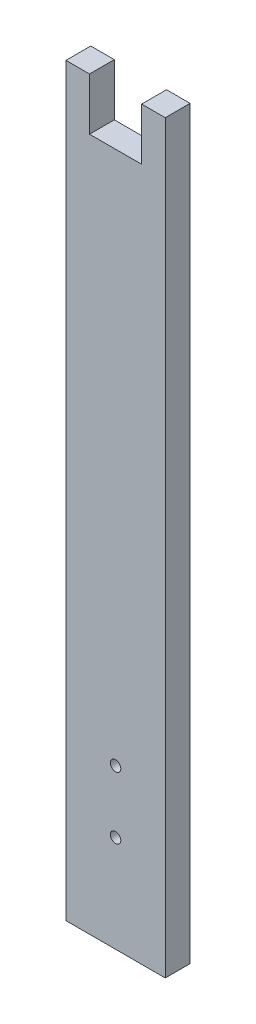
ISO-10303-21;
HEADER;
FILE_DESCRIPTION(('STEP AP214'),'2;1');
FILE_NAME('part.step','',(''),(''),'','','');
FILE_SCHEMA(('AUTOMOTIVE_DESIGN { 1 0 10303 214 1 1 1 1 }'));
ENDSEC;
DATA;
#1=APPLICATION_CONTEXT('core data for automotive mechanical design processes');
#2=APPLICATION_PROTOCOL_DEFINITION('international standard','automotive_design',2000,#1);
#3=PRODUCT_CONTEXT('',#1,'mechanical');
#4=PRODUCT('Part','Part','',(#3));
#5=PRODUCT_RELATED_PRODUCT_CATEGORY('part','',(#4));
#6=PRODUCT_DEFINITION_FORMATION('','',#4);
#7=PRODUCT_DEFINITION_CONTEXT('part definition',#1,'design');
#8=PRODUCT_DEFINITION('design','',#6,#7);
#9=PRODUCT_DEFINITION_SHAPE('','',#8);
#10=(LENGTH_UNIT() NAMED_UNIT(*) SI_UNIT(.MILLI.,.METRE.));
#11=(NAMED_UNIT(*) PLANE_ANGLE_UNIT() SI_UNIT($,.RADIAN.));
#12=(NAMED_UNIT(*) SI_UNIT($,.STERADIAN.) SOLID_ANGLE_UNIT());
#13=UNCERTAINTY_MEASURE_WITH_UNIT(LENGTH_MEASURE(1.E-05),#10,'distance_accuracy_value','');
#14=(GEOMETRIC_REPRESENTATION_CONTEXT(3) GLOBAL_UNCERTAINTY_ASSIGNED_CONTEXT((#13)) GLOBAL_UNIT_ASSIGNED_CONTEXT((#10,
#11,#12)) REPRESENTATION_CONTEXT('',''));
#15=CARTESIAN_POINT('',(0.,0.,0.));
#16=DIRECTION('',(0.,0.,1.));
#17=DIRECTION('',(1.,0.,0.));
#18=AXIS2_PLACEMENT_3D('',#15,#16,#17);
#19=CARTESIAN_POINT('',(-20.,300.,10.));
#20=DIRECTION('',(0.,-1.,0.));
#21=DIRECTION('',(0.,0.,-1.));
#22=AXIS2_PLACEMENT_3D('',#19,#20,#21);
#23=PLANE('',#22);
#24=DIRECTION('',(0.,0.,-1.));
#25=VECTOR('',#24,1.);
#26=CARTESIAN_POINT('',(-10.5,300.,10.));
#27=LINE('',#26,#25);
#28=CARTESIAN_POINT('',(-10.5,300.,10.));
#29=VERTEX_POINT('',#28);
#30=CARTESIAN_POINT('',(-10.5,300.,0.));
#31=VERTEX_POINT('',#30);
#32=EDGE_CURVE('E112',#29,#31,#27,.T.);
#33=ORIENTED_EDGE('',*,*,#32,.T.);
#34=DIRECTION('',(-1.,0.,0.));
#35=VECTOR('',#34,1.);
#36=CARTESIAN_POINT('',(-20.,300.,0.));
#37=LINE('',#36,#35);
#38=CARTESIAN_POINT('',(-20.,300.,0.));
#39=VERTEX_POINT('',#38);
#40=EDGE_CURVE('E78',#31,#39,#37,.T.);
#41=ORIENTED_EDGE('',*,*,#40,.T.);
#42=DIRECTION('',(0.,0.,-1.));
#43=VECTOR('',#42,1.);
#44=CARTESIAN_POINT('',(-20.,300.,10.));
#45=LINE('',#44,#43);
#46=CARTESIAN_POINT('',(-20.,300.,10.));
#47=VERTEX_POINT('',#46);
#48=EDGE_CURVE('E159',#47,#39,#45,.T.);
#49=ORIENTED_EDGE('',*,*,#48,.F.);
#50=DIRECTION('',(-1.,0.,0.));
#51=VECTOR('',#50,1.);
#52=CARTESIAN_POINT('',(-20.,300.,10.));
#53=LINE('',#52,#51);
#54=EDGE_CURVE('E56',#29,#47,#53,.T.);
#55=ORIENTED_EDGE('',*,*,#54,.F.);
#56=EDGE_LOOP('',(#33,#41,#49,#55));
#57=FACE_BOUND('',#56,.T.);
#58=ADVANCED_FACE('F32',(#57),#23,.F.);
#59=DIRECTION('',(0.,0.,-1.));
#60=VECTOR('',#59,1.);
#61=CARTESIAN_POINT('',(10.5,300.,10.));
#62=LINE('',#61,#60);
#63=CARTESIAN_POINT('',(10.5,300.,10.));
#64=VERTEX_POINT('',#63);
#65=CARTESIAN_POINT('',(10.5,300.,0.));
#66=VERTEX_POINT('',#65);
#67=EDGE_CURVE('E47',#64,#66,#62,.T.);
#68=ORIENTED_EDGE('',*,*,#67,.F.);
#69=CARTESIAN_POINT('',(20.,300.,10.));
#70=VERTEX_POINT('',#69);
#71=EDGE_CURVE('E157',#70,#64,#53,.T.);
#72=ORIENTED_EDGE('',*,*,#71,.F.);
#73=DIRECTION('',(0.,0.,-1.));
#74=VECTOR('',#73,1.);
#75=CARTESIAN_POINT('',(20.,300.,10.));
#76=LINE('',#75,#74);
#77=CARTESIAN_POINT('',(20.,300.,0.));
#78=VERTEX_POINT('',#77);
#79=EDGE_CURVE('E169',#70,#78,#76,.T.);
#80=ORIENTED_EDGE('',*,*,#79,.T.);
#81=EDGE_CURVE('E153',#78,#66,#37,.T.);
#82=ORIENTED_EDGE('',*,*,#81,.T.);
#83=EDGE_LOOP('',(#68,#72,#80,#82));
#84=FACE_BOUND('',#83,.T.);
#85=ADVANCED_FACE('F182',(#84),#23,.F.);
#86=CARTESIAN_POINT('',(0.,0.,10.));
#87=DIRECTION('',(0.,0.,1.));
#88=DIRECTION('',(1.,0.,0.));
#89=AXIS2_PLACEMENT_3D('',#86,#87,#88);
#90=PLANE('',#89);
#91=CARTESIAN_POINT('',(0.,64.,10.));
#92=DIRECTION('',(0.,0.,-1.));
#93=DIRECTION('',(-1.,0.,0.));
#94=AXIS2_PLACEMENT_3D('',#91,#92,#93);
#95=CIRCLE('',#94,2.1);
#96=CARTESIAN_POINT('',(-2.1,64.,10.));
#97=VERTEX_POINT('',#96);
#98=EDGE_CURVE('E139',#97,#97,#95,.T.);
#99=ORIENTED_EDGE('',*,*,#98,.T.);
#100=EDGE_LOOP('',(#99));
#101=FACE_BOUND('',#100,.T.);
#102=CARTESIAN_POINT('',(0.,39.,10.));
#103=DIRECTION('',(0.,0.,-1.));
#104=DIRECTION('',(-1.,0.,0.));
#105=AXIS2_PLACEMENT_3D('',#102,#103,#104);
#106=CIRCLE('',#105,2.1);
#107=CARTESIAN_POINT('',(-2.1,39.,10.));
#108=VERTEX_POINT('',#107);
#109=EDGE_CURVE('E146',#108,#108,#106,.T.);
#110=ORIENTED_EDGE('',*,*,#109,.T.);
#111=EDGE_LOOP('',(#110));
#112=FACE_BOUND('',#111,.T.);
#113=DIRECTION('',(1.,0.,0.));
#114=VECTOR('',#113,1.);
#115=CARTESIAN_POINT('',(-10.5,279.,10.));
#116=LINE('',#115,#114);
#117=CARTESIAN_POINT('',(-10.5,279.,10.));
#118=VERTEX_POINT('',#117);
#119=CARTESIAN_POINT('',(10.5,279.,10.));
#120=VERTEX_POINT('',#119);
#121=EDGE_CURVE('E114',#118,#120,#116,.T.);
#122=ORIENTED_EDGE('',*,*,#121,.F.);
#123=DIRECTION('',(0.,-1.,0.));
#124=VECTOR('',#123,1.);
#125=CARTESIAN_POINT('',(-10.5,300.,10.));
#126=LINE('',#125,#124);
#127=EDGE_CURVE('E107',#29,#118,#126,.T.);
#128=ORIENTED_EDGE('',*,*,#127,.F.);
#129=ORIENTED_EDGE('',*,*,#54,.T.);
#130=DIRECTION('',(0.,-1.,0.));
#131=VECTOR('',#130,1.);
#132=CARTESIAN_POINT('',(-20.,300.,10.));
#133=LINE('',#132,#131);
#134=CARTESIAN_POINT('',(-20.,0.,10.));
#135=VERTEX_POINT('',#134);
#136=EDGE_CURVE('E151',#47,#135,#133,.T.);
#137=ORIENTED_EDGE('',*,*,#136,.T.);
#138=DIRECTION('',(1.,0.,0.));
#139=VECTOR('',#138,1.);
#140=CARTESIAN_POINT('',(-20.,0.,10.));
#141=LINE('',#140,#139);
#142=CARTESIAN_POINT('',(20.,0.,10.));
#143=VERTEX_POINT('',#142);
#144=EDGE_CURVE('E85',#135,#143,#141,.T.);
#145=ORIENTED_EDGE('',*,*,#144,.T.);
#146=DIRECTION('',(0.,1.,0.));
#147=VECTOR('',#146,1.);
#148=CARTESIAN_POINT('',(20.,300.,10.));
#149=LINE('',#148,#147);
#150=EDGE_CURVE('E155',#143,#70,#149,.T.);
#151=ORIENTED_EDGE('',*,*,#150,.T.);
#152=ORIENTED_EDGE('',*,*,#71,.T.);
#153=DIRECTION('',(0.,1.,0.));
#154=VECTOR('',#153,1.);
#155=CARTESIAN_POINT('',(10.5,300.,10.));
#156=LINE('',#155,#154);
#157=EDGE_CURVE('E128',#120,#64,#156,.T.);
#158=ORIENTED_EDGE('',*,*,#157,.F.);
#159=EDGE_LOOP('',(#122,#128,#129,#137,#145,#151,#152,#158));
#160=FACE_BOUND('',#159,.T.);
#161=ADVANCED_FACE('F126',(#101,#112,#160),#90,.T.);
#162=CARTESIAN_POINT('',(0.,0.,0.));
#163=DIRECTION('',(0.,0.,1.));
#164=DIRECTION('',(1.,0.,0.));
#165=AXIS2_PLACEMENT_3D('',#162,#163,#164);
#166=PLANE('',#165);
#167=CARTESIAN_POINT('',(0.,39.,0.));
#168=DIRECTION('',(0.,0.,-1.));
#169=DIRECTION('',(-1.,0.,0.));
#170=AXIS2_PLACEMENT_3D('',#167,#168,#169);
#171=CIRCLE('',#170,2.1);
#172=CARTESIAN_POINT('',(-2.1,39.,0.));
#173=VERTEX_POINT('',#172);
#174=EDGE_CURVE('E122',#173,#173,#171,.T.);
#175=ORIENTED_EDGE('',*,*,#174,.F.);
#176=EDGE_LOOP('',(#175));
#177=FACE_BOUND('',#176,.T.);
#178=CARTESIAN_POINT('',(0.,64.,0.));
#179=DIRECTION('',(0.,0.,-1.));
#180=DIRECTION('',(-1.,0.,0.));
#181=AXIS2_PLACEMENT_3D('',#178,#179,#180);
#182=CIRCLE('',#181,2.1);
#183=CARTESIAN_POINT('',(-2.1,64.,0.));
#184=VERTEX_POINT('',#183);
#185=EDGE_CURVE('E143',#184,#184,#182,.T.);
#186=ORIENTED_EDGE('',*,*,#185,.F.);
#187=EDGE_LOOP('',(#186));
#188=FACE_BOUND('',#187,.T.);
#189=DIRECTION('',(0.,-1.,0.));
#190=VECTOR('',#189,1.);
#191=CARTESIAN_POINT('',(-10.5,300.,0.));
#192=LINE('',#191,#190);
#193=CARTESIAN_POINT('',(-10.5,279.,0.));
#194=VERTEX_POINT('',#193);
#195=EDGE_CURVE('E132',#31,#194,#192,.T.);
#196=ORIENTED_EDGE('',*,*,#195,.T.);
#197=DIRECTION('',(1.,0.,0.));
#198=VECTOR('',#197,1.);
#199=CARTESIAN_POINT('',(-10.5,279.,0.));
#200=LINE('',#199,#198);
#201=CARTESIAN_POINT('',(10.5,279.,0.));
#202=VERTEX_POINT('',#201);
#203=EDGE_CURVE('E121',#194,#202,#200,.T.);
#204=ORIENTED_EDGE('',*,*,#203,.T.);
#205=DIRECTION('',(0.,1.,0.));
#206=VECTOR('',#205,1.);
#207=CARTESIAN_POINT('',(10.5,300.,0.));
#208=LINE('',#207,#206);
#209=EDGE_CURVE('E115',#202,#66,#208,.T.);
#210=ORIENTED_EDGE('',*,*,#209,.T.);
#211=ORIENTED_EDGE('',*,*,#81,.F.);
#212=DIRECTION('',(0.,1.,0.));
#213=VECTOR('',#212,1.);
#214=CARTESIAN_POINT('',(20.,300.,0.));
#215=LINE('',#214,#213);
#216=CARTESIAN_POINT('',(20.,0.,0.));
#217=VERTEX_POINT('',#216);
#218=EDGE_CURVE('E164',#217,#78,#215,.T.);
#219=ORIENTED_EDGE('',*,*,#218,.F.);
#220=DIRECTION('',(1.,0.,0.));
#221=VECTOR('',#220,1.);
#222=CARTESIAN_POINT('',(-20.,0.,0.));
#223=LINE('',#222,#221);
#224=CARTESIAN_POINT('',(-20.,0.,0.));
#225=VERTEX_POINT('',#224);
#226=EDGE_CURVE('E162',#225,#217,#223,.T.);
#227=ORIENTED_EDGE('',*,*,#226,.F.);
#228=DIRECTION('',(0.,-1.,0.));
#229=VECTOR('',#228,1.);
#230=CARTESIAN_POINT('',(-20.,300.,0.));
#231=LINE('',#230,#229);
#232=EDGE_CURVE('E142',#39,#225,#231,.T.);
#233=ORIENTED_EDGE('',*,*,#232,.F.);
#234=ORIENTED_EDGE('',*,*,#40,.F.);
#235=EDGE_LOOP('',(#196,#204,#210,#211,#219,#227,#233,#234));
#236=FACE_BOUND('',#235,.T.);
#237=ADVANCED_FACE('F179',(#177,#188,#236),#166,.F.);
#238=CARTESIAN_POINT('',(-20.,300.,10.));
#239=DIRECTION('',(1.,0.,0.));
#240=DIRECTION('',(0.,1.,0.));
#241=AXIS2_PLACEMENT_3D('',#238,#239,#240);
#242=PLANE('',#241);
#243=ORIENTED_EDGE('',*,*,#232,.T.);
#244=DIRECTION('',(0.,0.,-1.));
#245=VECTOR('',#244,1.);
#246=CARTESIAN_POINT('',(-20.,0.,10.));
#247=LINE('',#246,#245);
#248=EDGE_CURVE('E11',#135,#225,#247,.T.);
#249=ORIENTED_EDGE('',*,*,#248,.F.);
#250=ORIENTED_EDGE('',*,*,#136,.F.);
#251=ORIENTED_EDGE('',*,*,#48,.T.);
#252=EDGE_LOOP('',(#243,#249,#250,#251));
#253=FACE_BOUND('',#252,.T.);
#254=ADVANCED_FACE('F34',(#253),#242,.F.);
#255=CARTESIAN_POINT('',(-20.,0.,10.));
#256=DIRECTION('',(0.,1.,0.));
#257=DIRECTION('',(-1.,0.,0.));
#258=AXIS2_PLACEMENT_3D('',#255,#256,#257);
#259=PLANE('',#258);
#260=ORIENTED_EDGE('',*,*,#226,.T.);
#261=DIRECTION('',(0.,0.,-1.));
#262=VECTOR('',#261,1.);
#263=CARTESIAN_POINT('',(20.,0.,10.));
#264=LINE('',#263,#262);
#265=EDGE_CURVE('E40',#143,#217,#264,.T.);
#266=ORIENTED_EDGE('',*,*,#265,.F.);
#267=ORIENTED_EDGE('',*,*,#144,.F.);
#268=ORIENTED_EDGE('',*,*,#248,.T.);
#269=EDGE_LOOP('',(#260,#266,#267,#268));
#270=FACE_BOUND('',#269,.T.);
#271=ADVANCED_FACE('F187',(#270),#259,.F.);
#272=CARTESIAN_POINT('',(20.,300.,10.));
#273=DIRECTION('',(-1.,0.,0.));
#274=DIRECTION('',(0.,-1.,0.));
#275=AXIS2_PLACEMENT_3D('',#272,#273,#274);
#276=PLANE('',#275);
#277=ORIENTED_EDGE('',*,*,#218,.T.);
#278=ORIENTED_EDGE('',*,*,#79,.F.);
#279=ORIENTED_EDGE('',*,*,#150,.F.);
#280=ORIENTED_EDGE('',*,*,#265,.T.);
#281=EDGE_LOOP('',(#277,#278,#279,#280));
#282=FACE_BOUND('',#281,.T.);
#283=ADVANCED_FACE('F175',(#282),#276,.F.);
#284=CARTESIAN_POINT('',(0.,39.,10.));
#285=DIRECTION('',(0.,0.,-1.));
#286=DIRECTION('',(-1.,0.,0.));
#287=AXIS2_PLACEMENT_3D('',#284,#285,#286);
#288=CYLINDRICAL_SURFACE('',#287,2.1);
#289=ORIENTED_EDGE('',*,*,#109,.F.);
#290=EDGE_LOOP('',(#289));
#291=FACE_BOUND('',#290,.T.);
#292=ORIENTED_EDGE('',*,*,#174,.T.);
#293=EDGE_LOOP('',(#292));
#294=FACE_BOUND('',#293,.T.);
#295=ADVANCED_FACE('F193',(#291,#294),#288,.F.);
#296=CARTESIAN_POINT('',(0.,64.,10.));
#297=DIRECTION('',(0.,0.,-1.));
#298=DIRECTION('',(-1.,0.,0.));
#299=AXIS2_PLACEMENT_3D('',#296,#297,#298);
#300=CYLINDRICAL_SURFACE('',#299,2.1);
#301=ORIENTED_EDGE('',*,*,#98,.F.);
#302=EDGE_LOOP('',(#301));
#303=FACE_BOUND('',#302,.T.);
#304=ORIENTED_EDGE('',*,*,#185,.T.);
#305=EDGE_LOOP('',(#304));
#306=FACE_BOUND('',#305,.T.);
#307=ADVANCED_FACE('F209',(#303,#306),#300,.F.);
#308=CARTESIAN_POINT('',(-10.5,300.,10.));
#309=DIRECTION('',(1.,0.,0.));
#310=DIRECTION('',(0.,1.,0.));
#311=AXIS2_PLACEMENT_3D('',#308,#309,#310);
#312=PLANE('',#311);
#313=ORIENTED_EDGE('',*,*,#195,.F.);
#314=ORIENTED_EDGE('',*,*,#32,.F.);
#315=ORIENTED_EDGE('',*,*,#127,.T.);
#316=DIRECTION('',(0.,0.,-1.));
#317=VECTOR('',#316,1.);
#318=CARTESIAN_POINT('',(-10.5,279.,10.));
#319=LINE('',#318,#317);
#320=EDGE_CURVE('E110',#118,#194,#319,.T.);
#321=ORIENTED_EDGE('',*,*,#320,.T.);
#322=EDGE_LOOP('',(#313,#314,#315,#321));
#323=FACE_BOUND('',#322,.T.);
#324=ADVANCED_FACE('F109',(#323),#312,.T.);
#325=CARTESIAN_POINT('',(-10.5,279.,10.));
#326=DIRECTION('',(0.,1.,0.));
#327=DIRECTION('',(0.,0.,1.));
#328=AXIS2_PLACEMENT_3D('',#325,#326,#327);
#329=PLANE('',#328);
#330=ORIENTED_EDGE('',*,*,#203,.F.);
#331=ORIENTED_EDGE('',*,*,#320,.F.);
#332=ORIENTED_EDGE('',*,*,#121,.T.);
#333=DIRECTION('',(0.,0.,-1.));
#334=VECTOR('',#333,1.);
#335=CARTESIAN_POINT('',(10.5,279.,10.));
#336=LINE('',#335,#334);
#337=EDGE_CURVE('E123',#120,#202,#336,.T.);
#338=ORIENTED_EDGE('',*,*,#337,.T.);
#339=EDGE_LOOP('',(#330,#331,#332,#338));
#340=FACE_BOUND('',#339,.T.);
#341=ADVANCED_FACE('F118',(#340),#329,.T.);
#342=CARTESIAN_POINT('',(10.5,300.,10.));
#343=DIRECTION('',(-1.,0.,0.));
#344=DIRECTION('',(0.,-1.,0.));
#345=AXIS2_PLACEMENT_3D('',#342,#343,#344);
#346=PLANE('',#345);
#347=ORIENTED_EDGE('',*,*,#209,.F.);
#348=ORIENTED_EDGE('',*,*,#337,.F.);
#349=ORIENTED_EDGE('',*,*,#157,.T.);
#350=ORIENTED_EDGE('',*,*,#67,.T.);
#351=EDGE_LOOP('',(#347,#348,#349,#350));
#352=FACE_BOUND('',#351,.T.);
#353=ADVANCED_FACE('F218',(#352),#346,.T.);
#354=CLOSED_SHELL('',(#58,#85,#161,#237,#254,#271,#283,#295,#307,#324,#341,#353));
#355=MANIFOLD_SOLID_BREP('B2',#354);
#356=ADVANCED_BREP_SHAPE_REPRESENTATION('',(#18,#355),#14);
#357=SHAPE_DEFINITION_REPRESENTATION(#9,#356);
ENDSEC;
END-ISO-10303-21;
